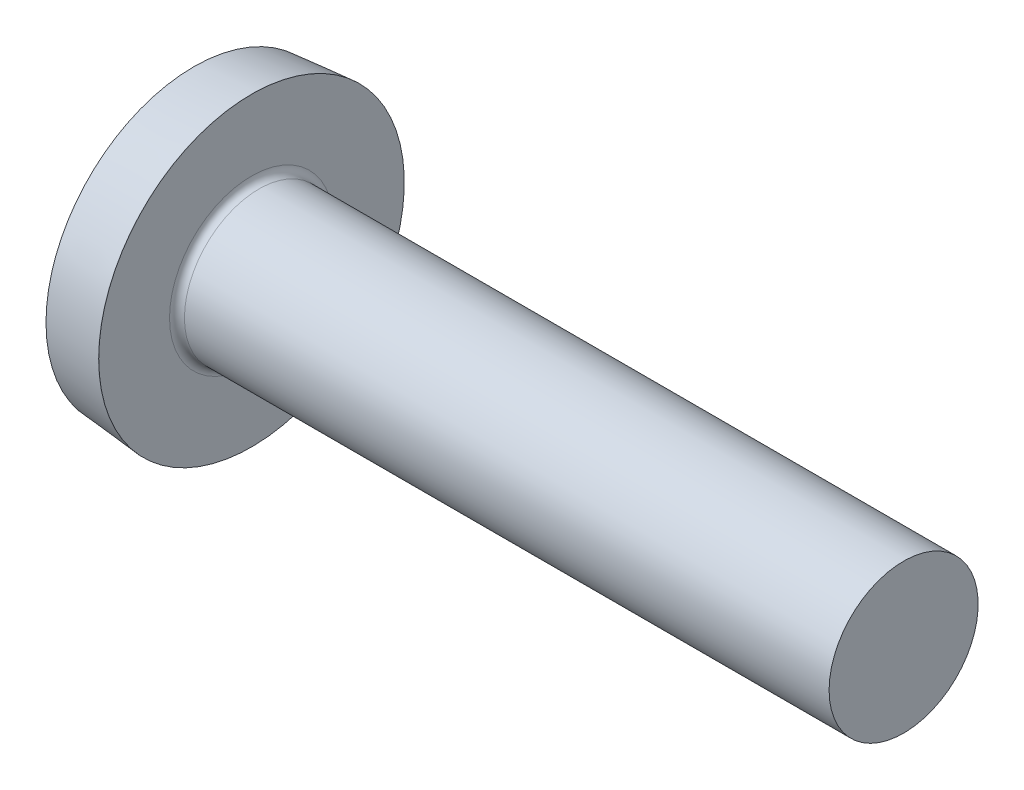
ISO-10303-21;
HEADER;
FILE_DESCRIPTION(('STEP AP214'),'2;1');
FILE_NAME('part.step','',(''),(''),'','','');
FILE_SCHEMA(('AUTOMOTIVE_DESIGN { 1 0 10303 214 1 1 1 1 }'));
ENDSEC;
DATA;
#1=APPLICATION_CONTEXT('core data for automotive mechanical design processes');
#2=APPLICATION_PROTOCOL_DEFINITION('international standard','automotive_design',2000,#1);
#3=PRODUCT_CONTEXT('',#1,'mechanical');
#4=PRODUCT('Part','Part','',(#3));
#5=PRODUCT_RELATED_PRODUCT_CATEGORY('part','',(#4));
#6=PRODUCT_DEFINITION_FORMATION('','',#4);
#7=PRODUCT_DEFINITION_CONTEXT('part definition',#1,'design');
#8=PRODUCT_DEFINITION('design','',#6,#7);
#9=PRODUCT_DEFINITION_SHAPE('','',#8);
#10=(LENGTH_UNIT() NAMED_UNIT(*) SI_UNIT(.MILLI.,.METRE.));
#11=(NAMED_UNIT(*) PLANE_ANGLE_UNIT() SI_UNIT($,.RADIAN.));
#12=(NAMED_UNIT(*) SI_UNIT($,.STERADIAN.) SOLID_ANGLE_UNIT());
#13=UNCERTAINTY_MEASURE_WITH_UNIT(LENGTH_MEASURE(1.E-05),#10,'distance_accuracy_value','');
#14=(GEOMETRIC_REPRESENTATION_CONTEXT(3) GLOBAL_UNCERTAINTY_ASSIGNED_CONTEXT((#13)) GLOBAL_UNIT_ASSIGNED_CONTEXT((#10,
#11,#12)) REPRESENTATION_CONTEXT('',''));
#15=CARTESIAN_POINT('',(0.,0.,0.));
#16=DIRECTION('',(0.,0.,1.));
#17=DIRECTION('',(1.,0.,0.));
#18=AXIS2_PLACEMENT_3D('',#15,#16,#17);
#19=CARTESIAN_POINT('',(19.3439729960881,0.,0.));
#20=DIRECTION('',(-1.,0.,0.));
#21=DIRECTION('',(0.,1.,0.));
#22=AXIS2_PLACEMENT_3D('',#19,#20,#21);
#23=SPHERICAL_SURFACE('',#22,19.3439729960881);
#24=CARTESIAN_POINT('',(1.7,0.,0.));
#25=DIRECTION('',(-1.,0.,0.));
#26=DIRECTION('',(0.,0.,1.));
#27=AXIS2_PLACEMENT_3D('',#24,#25,#26);
#28=CIRCLE('',#27,7.9296600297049);
#29=CARTESIAN_POINT('',(1.7,0.,7.9296600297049));
#30=VERTEX_POINT('',#29);
#31=EDGE_CURVE('E221',#30,#30,#28,.T.);
#32=ORIENTED_EDGE('',*,*,#31,.T.);
#33=EDGE_LOOP('',(#32));
#34=FACE_BOUND('',#33,.T.);
#35=CARTESIAN_POINT('',(0.0647047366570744,0.,0.));
#36=DIRECTION('',(1.,0.,0.));
#37=DIRECTION('',(0.,0.,-1.));
#38=AXIS2_PLACEMENT_3D('',#35,#36,#37);
#39=CIRCLE('',#38,1.5808563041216);
#40=CARTESIAN_POINT('',(0.0647047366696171,-0.709999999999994,-1.41244704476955));
#41=VERTEX_POINT('',#40);
#42=CARTESIAN_POINT('',(0.0647047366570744,-1.41244704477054,-0.71));
#43=VERTEX_POINT('',#42);
#44=EDGE_CURVE('E348',#41,#43,#39,.F.);
#45=ORIENTED_EDGE('',*,*,#44,.F.);
#46=CARTESIAN_POINT('',(19.3439729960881,-0.71,0.));
#47=DIRECTION('',(0.,1.,0.));
#48=DIRECTION('',(0.,0.,1.));
#49=AXIS2_PLACEMENT_3D('',#46,#47,#48);
#50=CIRCLE('',#49,19.3309387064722);
#51=CARTESIAN_POINT('',(0.373159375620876,-0.709999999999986,-3.71394962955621));
#52=VERTEX_POINT('',#51);
#53=EDGE_CURVE('E281',#52,#41,#50,.T.);
#54=ORIENTED_EDGE('',*,*,#53,.F.);
#55=CARTESIAN_POINT('',(17.0500733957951,0.,4.6008515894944));
#56=DIRECTION('',(0.446197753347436,0.,-0.894934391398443));
#57=DIRECTION('',(-0.894934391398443,0.,-0.446197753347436));
#58=AXIS2_PLACEMENT_3D('',#55,#56,#57);
#59=CIRCLE('',#58,18.6483103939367);
#60=CARTESIAN_POINT('',(0.373159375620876,0.710000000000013,-3.71394962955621));
#61=VERTEX_POINT('',#60);
#62=EDGE_CURVE('E255',#52,#61,#59,.T.);
#63=ORIENTED_EDGE('',*,*,#62,.T.);
#64=CARTESIAN_POINT('',(19.3439729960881,0.71,0.));
#65=DIRECTION('',(0.,-1.,0.));
#66=DIRECTION('',(0.,0.,-1.));
#67=AXIS2_PLACEMENT_3D('',#64,#65,#66);
#68=CIRCLE('',#67,19.3309387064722);
#69=CARTESIAN_POINT('',(0.0647047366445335,0.710000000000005,-1.41244704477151));
#70=VERTEX_POINT('',#69);
#71=EDGE_CURVE('E310',#70,#61,#68,.T.);
#72=ORIENTED_EDGE('',*,*,#71,.F.);
#73=CARTESIAN_POINT('',(0.0647047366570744,1.41244704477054,-0.71));
#74=VERTEX_POINT('',#73);
#75=EDGE_CURVE('E363',#74,#70,#39,.F.);
#76=ORIENTED_EDGE('',*,*,#75,.F.);
#77=CARTESIAN_POINT('',(19.3439729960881,0.,-0.71));
#78=DIRECTION('',(0.,0.,1.));
#79=DIRECTION('',(1.,0.,0.));
#80=AXIS2_PLACEMENT_3D('',#77,#78,#79);
#81=CIRCLE('',#80,19.3309387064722);
#82=CARTESIAN_POINT('',(0.373159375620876,3.71394962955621,-0.71));
#83=VERTEX_POINT('',#82);
#84=EDGE_CURVE('E249',#83,#74,#81,.T.);
#85=ORIENTED_EDGE('',*,*,#84,.F.);
#86=CARTESIAN_POINT('',(17.0500733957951,-4.6008515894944,0.));
#87=DIRECTION('',(0.446197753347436,0.894934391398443,0.));
#88=DIRECTION('',(-0.894934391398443,0.446197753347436,0.));
#89=AXIS2_PLACEMENT_3D('',#86,#87,#88);
#90=CIRCLE('',#89,18.6483103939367);
#91=CARTESIAN_POINT('',(0.373159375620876,3.71394962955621,0.71));
#92=VERTEX_POINT('',#91);
#93=EDGE_CURVE('E252',#83,#92,#90,.T.);
#94=ORIENTED_EDGE('',*,*,#93,.T.);
#95=CARTESIAN_POINT('',(19.3439729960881,0.,0.71));
#96=DIRECTION('',(0.,0.,-1.));
#97=DIRECTION('',(0.,1.,0.));
#98=AXIS2_PLACEMENT_3D('',#95,#96,#97);
#99=CIRCLE('',#98,19.3309387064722);
#100=CARTESIAN_POINT('',(0.0647047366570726,1.41244704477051,0.71));
#101=VERTEX_POINT('',#100);
#102=EDGE_CURVE('E245',#101,#92,#99,.T.);
#103=ORIENTED_EDGE('',*,*,#102,.F.);
#104=CARTESIAN_POINT('',(0.0647047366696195,0.709999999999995,1.41244704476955));
#105=VERTEX_POINT('',#104);
#106=EDGE_CURVE('E362',#105,#101,#39,.F.);
#107=ORIENTED_EDGE('',*,*,#106,.F.);
#108=CARTESIAN_POINT('',(0.373159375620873,0.709999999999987,3.71394962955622));
#109=VERTEX_POINT('',#108);
#110=EDGE_CURVE('E265',#109,#105,#68,.T.);
#111=ORIENTED_EDGE('',*,*,#110,.F.);
#112=CARTESIAN_POINT('',(17.0500733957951,0.,-4.6008515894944));
#113=DIRECTION('',(0.446197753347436,0.,0.894934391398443));
#114=DIRECTION('',(0.894934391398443,0.,-0.446197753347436));
#115=AXIS2_PLACEMENT_3D('',#112,#113,#114);
#116=CIRCLE('',#115,18.6483103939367);
#117=CARTESIAN_POINT('',(0.373159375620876,-0.710000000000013,3.71394962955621));
#118=VERTEX_POINT('',#117);
#119=EDGE_CURVE('E55',#109,#118,#116,.T.);
#120=ORIENTED_EDGE('',*,*,#119,.T.);
#121=CARTESIAN_POINT('',(0.064704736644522,-0.710000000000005,1.41244704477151));
#122=VERTEX_POINT('',#121);
#123=EDGE_CURVE('E262',#122,#118,#50,.T.);
#124=ORIENTED_EDGE('',*,*,#123,.F.);
#125=CARTESIAN_POINT('',(0.0647047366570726,-1.41244704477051,0.709999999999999));
#126=VERTEX_POINT('',#125);
#127=EDGE_CURVE('E398',#126,#122,#39,.F.);
#128=ORIENTED_EDGE('',*,*,#127,.F.);
#129=CARTESIAN_POINT('',(0.373159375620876,-3.71394962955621,0.709999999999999));
#130=VERTEX_POINT('',#129);
#131=EDGE_CURVE('E246',#130,#126,#99,.T.);
#132=ORIENTED_EDGE('',*,*,#131,.F.);
#133=CARTESIAN_POINT('',(17.0500733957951,4.6008515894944,0.));
#134=DIRECTION('',(0.446197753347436,-0.894934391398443,0.));
#135=DIRECTION('',(0.894934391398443,0.446197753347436,0.));
#136=AXIS2_PLACEMENT_3D('',#133,#134,#135);
#137=CIRCLE('',#136,18.6483103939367);
#138=CARTESIAN_POINT('',(0.373159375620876,-3.71394962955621,-0.71));
#139=VERTEX_POINT('',#138);
#140=EDGE_CURVE('E242',#130,#139,#137,.T.);
#141=ORIENTED_EDGE('',*,*,#140,.T.);
#142=EDGE_CURVE('E70',#43,#139,#81,.T.);
#143=ORIENTED_EDGE('',*,*,#142,.F.);
#144=EDGE_LOOP('',(#45,#54,#63,#72,#76,#85,#94,#103,#107,#111,#120,#124,#128,#132,#141,#143));
#145=FACE_BOUND('',#144,.T.);
#146=ADVANCED_FACE('F41',(#34,#145),#23,.T.);
#147=CARTESIAN_POINT('',(4.36,1.72618455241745,-0.71));
#148=DIRECTION('',(0.,0.,1.));
#149=DIRECTION('',(1.,0.,0.));
#150=AXIS2_PLACEMENT_3D('',#147,#148,#149);
#151=PLANE('',#150);
#152=ORIENTED_EDGE('',*,*,#84,.T.);
#153=CARTESIAN_POINT('',(-2.29252492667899,1.59478308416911,-0.71));
#154=CARTESIAN_POINT('',(-1.81270612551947,1.55804915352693,-0.71));
#155=CARTESIAN_POINT('',(-1.33290213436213,1.52111940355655,-0.71));
#156=CARTESIAN_POINT('',(-0.373323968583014,1.44673819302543,-0.71));
#157=CARTESIAN_POINT('',(0.106450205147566,1.40928672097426,-0.71));
#158=CARTESIAN_POINT('',(0.826073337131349,1.35262186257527,-0.71));
#159=CARTESIAN_POINT('',(1.06594148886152,1.33365229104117,-0.71));
#160=CARTESIAN_POINT('',(1.54566207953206,1.29552719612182,-0.71));
#161=CARTESIAN_POINT('',(1.78551451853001,1.27637167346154,-0.71));
#162=CARTESIAN_POINT('',(2.26519681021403,1.23784891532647,-0.71));
#163=CARTESIAN_POINT('',(2.50502666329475,1.21848168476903,-0.71));
#164=CARTESIAN_POINT('',(2.98466976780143,1.17950227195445,-0.71));
#165=CARTESIAN_POINT('',(3.22448301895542,1.1598900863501,-0.71));
#166=CARTESIAN_POINT('',(3.80617038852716,1.11197280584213,-0.71));
#167=CARTESIAN_POINT('',(4.14803247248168,1.0835212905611,-0.71));
#168=CARTESIAN_POINT('',(4.83169311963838,1.02589242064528,-0.71));
#169=CARTESIAN_POINT('',(5.17349168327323,0.996715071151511,-0.71));
#170=CARTESIAN_POINT('',(5.8569822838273,0.937423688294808,-0.71));
#171=CARTESIAN_POINT('',(6.19867432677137,0.907309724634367,-0.71));
#172=CARTESIAN_POINT('',(6.88195546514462,0.845823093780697,-0.71));
#173=CARTESIAN_POINT('',(7.22354455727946,0.814450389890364,-0.71));
#174=CARTESIAN_POINT('',(7.90666332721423,0.749944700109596,-0.71));
#175=CARTESIAN_POINT('',(8.24819295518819,0.716811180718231,-0.71));
#176=CARTESIAN_POINT('',(8.76027240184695,0.665129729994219,-0.71));
#177=CARTESIAN_POINT('',(8.93092214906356,0.64757320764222,-0.71));
#178=CARTESIAN_POINT('',(9.27213637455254,0.611612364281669,-0.71));
#179=CARTESIAN_POINT('',(9.44270085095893,0.593208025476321,-0.71));
#180=CARTESIAN_POINT('',(9.78376758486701,0.555282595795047,-0.71));
#181=CARTESIAN_POINT('',(9.95426979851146,0.53576110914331,-0.71));
#182=CARTESIAN_POINT('',(10.2950864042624,0.495201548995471,-0.71));
#183=CARTESIAN_POINT('',(10.4654008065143,0.474163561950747,-0.71));
#184=CARTESIAN_POINT('',(10.7206812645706,0.440920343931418,-0.71));
#185=CARTESIAN_POINT('',(10.805756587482,0.42955626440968,-0.71));
#186=CARTESIAN_POINT('',(10.9758063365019,0.406110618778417,-0.71));
#187=CARTESIAN_POINT('',(11.0607807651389,0.394029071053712,-0.71));
#188=CARTESIAN_POINT('',(11.2306124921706,0.368945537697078,-0.71));
#189=CARTESIAN_POINT('',(11.3154697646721,0.355943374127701,-0.71));
#190=CARTESIAN_POINT('',(11.4849791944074,0.32862517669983,-0.71));
#191=CARTESIAN_POINT('',(11.5696313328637,0.314309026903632,-0.71));
#192=CARTESIAN_POINT('',(11.6541376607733,0.299139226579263,-0.71));
#193=B_SPLINE_CURVE_WITH_KNOTS('',3,(#153,#154,#155,#156,#157,#158,#159,#160,#161,#162,#163,
#164,#165,#166,#167,#168,#169,#170,#171,#172,#173,#174,#175,#176,#177,#178,#179,#180,#181,#182,
#183,#184,#185,#186,#187,#188,#189,#190,#191,#192),.UNSPECIFIED.,.F.,.F.,(4,2,2,2,2,2,2,2,2,2,2,
2,2,2,2,2,2,2,2,4),(0.,1.44366890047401,2.88736964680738,3.60922079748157,4.33106913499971,
5.05290074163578,5.77474222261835,6.80387353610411,7.83299756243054,8.86204518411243,
9.89112282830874,10.9205140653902,11.4351640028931,11.9498247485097,12.464668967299,
12.9794838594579,13.2369743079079,13.4944581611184,13.7519919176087,14.009548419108),.UNSPECIFIED.);
#194=CARTESIAN_POINT('',(4.36,1.06563607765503,-0.71));
#195=VERTEX_POINT('',#194);
#196=EDGE_CURVE('E385',#74,#195,#193,.T.);
#197=ORIENTED_EDGE('',*,*,#196,.T.);
#198=DIRECTION('',(0.,1.,0.));
#199=VECTOR('',#198,1.);
#200=CARTESIAN_POINT('',(4.36,-1.72618455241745,-0.71));
#201=LINE('',#200,#199);
#202=CARTESIAN_POINT('',(4.36,1.72618455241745,-0.71));
#203=VERTEX_POINT('',#202);
#204=EDGE_CURVE('E331',#195,#203,#201,.T.);
#205=ORIENTED_EDGE('',*,*,#204,.T.);
#206=DIRECTION('',(0.894934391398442,-0.446197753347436,0.));
#207=VECTOR('',#206,1.);
#208=CARTESIAN_POINT('',(0.,3.9,-0.71));
#209=LINE('',#208,#207);
#210=EDGE_CURVE('E222',#83,#203,#209,.T.);
#211=ORIENTED_EDGE('',*,*,#210,.F.);
#212=EDGE_LOOP('',(#152,#197,#205,#211));
#213=FACE_BOUND('',#212,.T.);
#214=ADVANCED_FACE('F176',(#213),#151,.T.);
#215=CARTESIAN_POINT('',(4.36,-1.72618455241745,-0.71));
#216=VERTEX_POINT('',#215);
#217=CARTESIAN_POINT('',(4.36,-1.06563607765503,-0.71));
#218=VERTEX_POINT('',#217);
#219=EDGE_CURVE('E230',#216,#218,#201,.T.);
#220=ORIENTED_EDGE('',*,*,#219,.T.);
#221=CARTESIAN_POINT('',(-2.29252492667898,-1.59478308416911,-0.71));
#222=CARTESIAN_POINT('',(-1.81270612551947,-1.55804915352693,-0.71));
#223=CARTESIAN_POINT('',(-1.33290213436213,-1.52111940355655,-0.71));
#224=CARTESIAN_POINT('',(-0.373323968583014,-1.44673819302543,-0.71));
#225=CARTESIAN_POINT('',(0.106450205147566,-1.40928672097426,-0.71));
#226=CARTESIAN_POINT('',(0.82607333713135,-1.35262186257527,-0.71));
#227=CARTESIAN_POINT('',(1.06594148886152,-1.33365229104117,-0.71));
#228=CARTESIAN_POINT('',(1.54566207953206,-1.29552719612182,-0.71));
#229=CARTESIAN_POINT('',(1.78551451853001,-1.27637167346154,-0.71));
#230=CARTESIAN_POINT('',(2.26519681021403,-1.23784891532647,-0.71));
#231=CARTESIAN_POINT('',(2.50502666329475,-1.21848168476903,-0.71));
#232=CARTESIAN_POINT('',(2.98466976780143,-1.17950227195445,-0.71));
#233=CARTESIAN_POINT('',(3.22448301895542,-1.1598900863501,-0.71));
#234=CARTESIAN_POINT('',(3.80617038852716,-1.11197280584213,-0.71));
#235=CARTESIAN_POINT('',(4.14803247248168,-1.0835212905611,-0.71));
#236=CARTESIAN_POINT('',(4.83169311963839,-1.02589242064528,-0.71));
#237=CARTESIAN_POINT('',(5.17349168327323,-0.996715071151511,-0.71));
#238=CARTESIAN_POINT('',(5.8569822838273,-0.937423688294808,-0.71));
#239=CARTESIAN_POINT('',(6.19867432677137,-0.907309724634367,-0.71));
#240=CARTESIAN_POINT('',(6.88195546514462,-0.845823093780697,-0.71));
#241=CARTESIAN_POINT('',(7.22354455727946,-0.814450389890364,-0.71));
#242=CARTESIAN_POINT('',(7.90666332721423,-0.749944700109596,-0.71));
#243=CARTESIAN_POINT('',(8.24819295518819,-0.716811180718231,-0.71));
#244=CARTESIAN_POINT('',(8.76027240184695,-0.665129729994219,-0.71));
#245=CARTESIAN_POINT('',(8.93092214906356,-0.64757320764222,-0.71));
#246=CARTESIAN_POINT('',(9.27213637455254,-0.611612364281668,-0.71));
#247=CARTESIAN_POINT('',(9.44270085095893,-0.593208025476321,-0.71));
#248=CARTESIAN_POINT('',(9.78376758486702,-0.555282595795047,-0.71));
#249=CARTESIAN_POINT('',(9.95426979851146,-0.53576110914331,-0.71));
#250=CARTESIAN_POINT('',(10.2950864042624,-0.49520154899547,-0.71));
#251=CARTESIAN_POINT('',(10.4654008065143,-0.474163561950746,-0.71));
#252=CARTESIAN_POINT('',(10.7206812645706,-0.440920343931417,-0.71));
#253=CARTESIAN_POINT('',(10.805756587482,-0.429556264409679,-0.71));
#254=CARTESIAN_POINT('',(10.9758063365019,-0.406110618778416,-0.71));
#255=CARTESIAN_POINT('',(11.0607807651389,-0.394029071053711,-0.71));
#256=CARTESIAN_POINT('',(11.2306124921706,-0.368945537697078,-0.71));
#257=CARTESIAN_POINT('',(11.3154697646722,-0.3559433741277,-0.71));
#258=CARTESIAN_POINT('',(11.4849791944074,-0.328625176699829,-0.71));
#259=CARTESIAN_POINT('',(11.5696313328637,-0.314309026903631,-0.71));
#260=CARTESIAN_POINT('',(11.6541376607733,-0.299139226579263,-0.71));
#261=B_SPLINE_CURVE_WITH_KNOTS('',3,(#221,#222,#223,#224,#225,#226,#227,#228,#229,#230,#231,
#232,#233,#234,#235,#236,#237,#238,#239,#240,#241,#242,#243,#244,#245,#246,#247,#248,#249,#250,
#251,#252,#253,#254,#255,#256,#257,#258,#259,#260),.UNSPECIFIED.,.F.,.F.,(4,2,2,2,2,2,2,2,2,2,2,
2,2,2,2,2,2,2,2,4),(0.,1.44366890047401,2.88736964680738,3.60922079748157,4.33106913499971,
5.05290074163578,5.77474222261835,6.80387353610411,7.83299756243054,8.86204518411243,
9.89112282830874,10.9205140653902,11.4351640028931,11.9498247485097,12.464668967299,
12.9794838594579,13.2369743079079,13.4944581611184,13.7519919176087,14.0095484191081),.UNSPECIFIED.);
#262=EDGE_CURVE('E361',#218,#43,#261,.F.);
#263=ORIENTED_EDGE('',*,*,#262,.T.);
#264=ORIENTED_EDGE('',*,*,#142,.T.);
#265=DIRECTION('',(0.894934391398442,0.446197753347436,0.));
#266=VECTOR('',#265,1.);
#267=CARTESIAN_POINT('',(0.,-3.9,-0.71));
#268=LINE('',#267,#266);
#269=EDGE_CURVE('E313',#139,#216,#268,.T.);
#270=ORIENTED_EDGE('',*,*,#269,.T.);
#271=EDGE_LOOP('',(#220,#263,#264,#270));
#272=FACE_BOUND('',#271,.T.);
#273=ADVANCED_FACE('F183',(#272),#151,.T.);
#274=CARTESIAN_POINT('',(4.36,-1.72618455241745,0.71));
#275=DIRECTION('',(0.,0.,-1.));
#276=DIRECTION('',(0.,1.,0.));
#277=AXIS2_PLACEMENT_3D('',#274,#275,#276);
#278=PLANE('',#277);
#279=DIRECTION('',(0.,-1.,0.));
#280=VECTOR('',#279,1.);
#281=CARTESIAN_POINT('',(4.36,1.72618455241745,0.71));
#282=LINE('',#281,#280);
#283=CARTESIAN_POINT('',(4.36,1.72618455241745,0.71));
#284=VERTEX_POINT('',#283);
#285=CARTESIAN_POINT('',(4.36,1.06563607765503,0.709999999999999));
#286=VERTEX_POINT('',#285);
#287=EDGE_CURVE('E321',#284,#286,#282,.T.);
#288=ORIENTED_EDGE('',*,*,#287,.T.);
#289=CARTESIAN_POINT('',(-2.29252491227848,1.59478308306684,0.71));
#290=CARTESIAN_POINT('',(-1.81270611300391,1.55804915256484,0.71));
#291=CARTESIAN_POINT('',(-1.33290212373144,1.52111940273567,0.71));
#292=CARTESIAN_POINT('',(-0.373323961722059,1.44673819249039,0.71));
#293=CARTESIAN_POINT('',(0.106450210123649,1.40928672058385,0.71));
#294=CARTESIAN_POINT('',(0.826073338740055,1.35262186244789,0.71));
#295=CARTESIAN_POINT('',(1.06594148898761,1.3336522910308,0.71));
#296=CARTESIAN_POINT('',(1.54566207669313,1.2955271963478,0.71));
#297=CARTESIAN_POINT('',(1.78551451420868,1.27637167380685,0.71));
#298=CARTESIAN_POINT('',(2.26519680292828,1.23784891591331,0.71));
#299=CARTESIAN_POINT('',(2.50502665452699,1.21848168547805,0.71));
#300=CARTESIAN_POINT('',(2.98466975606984,1.17950227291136,0.71));
#301=CARTESIAN_POINT('',(3.22448300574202,1.15989008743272,0.71));
#302=CARTESIAN_POINT('',(3.80617037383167,1.11197280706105,0.71));
#303=CARTESIAN_POINT('',(4.1480324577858,1.08352129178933,0.71));
#304=CARTESIAN_POINT('',(4.83169310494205,1.02589242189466,0.71));
#305=CARTESIAN_POINT('',(5.17349166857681,0.99671507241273,0.71));
#306=CARTESIAN_POINT('',(5.85698226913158,0.937423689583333,0.71));
#307=CARTESIAN_POINT('',(6.19867431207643,0.907309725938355,0.71));
#308=CARTESIAN_POINT('',(6.88195545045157,0.845823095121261,0.71));
#309=CARTESIAN_POINT('',(7.22354454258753,0.81445039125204,0.71));
#310=CARTESIAN_POINT('',(7.90666331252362,0.749944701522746,0.71));
#311=CARTESIAN_POINT('',(8.2481929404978,0.716811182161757,0.71));
#312=CARTESIAN_POINT('',(8.76027238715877,0.665129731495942,0.71));
#313=CARTESIAN_POINT('',(8.93092213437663,0.647573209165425,0.71));
#314=CARTESIAN_POINT('',(9.27213635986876,0.611612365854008,0.71));
#315=CARTESIAN_POINT('',(9.44270083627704,0.593208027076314,0.71));
#316=CARTESIAN_POINT('',(9.78376757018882,0.555282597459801,0.71));
#317=CARTESIAN_POINT('',(9.95426978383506,0.535761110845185,0.71));
#318=CARTESIAN_POINT('',(10.295086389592,0.495201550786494,0.71));
#319=CARTESIAN_POINT('',(10.4654007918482,0.474163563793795,0.71));
#320=CARTESIAN_POINT('',(10.7206812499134,0.440920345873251,0.71));
#321=CARTESIAN_POINT('',(10.8057565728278,0.429556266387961,0.71));
#322=CARTESIAN_POINT('',(10.9758063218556,0.406110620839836,0.71));
#323=CARTESIAN_POINT('',(11.0607807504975,0.39402907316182,0.71));
#324=CARTESIAN_POINT('',(11.230612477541,0.368945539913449,0.71));
#325=CARTESIAN_POINT('',(11.3154697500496,0.355943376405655,0.71));
#326=CARTESIAN_POINT('',(11.4849791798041,0.328625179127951,0.71));
#327=CARTESIAN_POINT('',(11.5696313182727,0.314309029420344,0.71));
#328=CARTESIAN_POINT('',(11.6541376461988,0.299139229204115,0.71));
#329=B_SPLINE_CURVE_WITH_KNOTS('',3,(#289,#290,#291,#292,#293,#294,#295,#296,#297,#298,#299,
#300,#301,#302,#303,#304,#305,#306,#307,#308,#309,#310,#311,#312,#313,#314,#315,#316,#317,#318,
#319,#320,#321,#322,#323,#324,#325,#326,#327,#328),.UNSPECIFIED.,.F.,.F.,(4,2,2,2,2,2,2,2,2,2,2,
2,2,2,2,2,2,2,2,4),(0.,1.44366889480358,2.88736963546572,3.60922078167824,4.33106911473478,
5.05290071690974,5.77474219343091,6.80387350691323,7.8329975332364,8.86204515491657,
9.89112279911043,10.9205140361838,11.4351639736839,11.9498247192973,12.4646689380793,
12.979483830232,13.2369742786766,13.4944581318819,13.7519918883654,14.0095483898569),.UNSPECIFIED.);
#330=EDGE_CURVE('E286',#286,#101,#329,.F.);
#331=ORIENTED_EDGE('',*,*,#330,.T.);
#332=ORIENTED_EDGE('',*,*,#102,.T.);
#333=DIRECTION('',(0.894934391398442,-0.446197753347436,0.));
#334=VECTOR('',#333,1.);
#335=CARTESIAN_POINT('',(0.,3.9,0.71));
#336=LINE('',#335,#334);
#337=EDGE_CURVE('E227',#92,#284,#336,.T.);
#338=ORIENTED_EDGE('',*,*,#337,.T.);
#339=EDGE_LOOP('',(#288,#331,#332,#338));
#340=FACE_BOUND('',#339,.T.);
#341=ADVANCED_FACE('F381',(#340),#278,.T.);
#342=ORIENTED_EDGE('',*,*,#131,.T.);
#343=CARTESIAN_POINT('',(-2.29252491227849,-1.59478308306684,0.709999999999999));
#344=CARTESIAN_POINT('',(-1.81270611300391,-1.55804915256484,0.709999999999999));
#345=CARTESIAN_POINT('',(-1.33290212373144,-1.52111940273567,0.709999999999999));
#346=CARTESIAN_POINT('',(-0.373323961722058,-1.44673819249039,0.709999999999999));
#347=CARTESIAN_POINT('',(0.10645021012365,-1.40928672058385,0.709999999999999));
#348=CARTESIAN_POINT('',(0.826073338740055,-1.3526218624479,0.709999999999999));
#349=CARTESIAN_POINT('',(1.06594148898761,-1.3336522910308,0.709999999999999));
#350=CARTESIAN_POINT('',(1.54566207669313,-1.2955271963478,0.709999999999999));
#351=CARTESIAN_POINT('',(1.78551451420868,-1.27637167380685,0.709999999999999));
#352=CARTESIAN_POINT('',(2.26519680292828,-1.23784891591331,0.709999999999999));
#353=CARTESIAN_POINT('',(2.50502665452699,-1.21848168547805,0.71));
#354=CARTESIAN_POINT('',(2.98466975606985,-1.17950227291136,0.71));
#355=CARTESIAN_POINT('',(3.22448300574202,-1.15989008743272,0.71));
#356=CARTESIAN_POINT('',(3.80617037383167,-1.11197280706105,0.71));
#357=CARTESIAN_POINT('',(4.1480324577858,-1.08352129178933,0.71));
#358=CARTESIAN_POINT('',(4.83169310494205,-1.02589242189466,0.71));
#359=CARTESIAN_POINT('',(5.17349166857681,-0.99671507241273,0.71));
#360=CARTESIAN_POINT('',(5.85698226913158,-0.937423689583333,0.71));
#361=CARTESIAN_POINT('',(6.19867431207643,-0.907309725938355,0.71));
#362=CARTESIAN_POINT('',(6.88195545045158,-0.845823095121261,0.71));
#363=CARTESIAN_POINT('',(7.22354454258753,-0.81445039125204,0.71));
#364=CARTESIAN_POINT('',(7.90666331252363,-0.749944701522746,0.71));
#365=CARTESIAN_POINT('',(8.24819294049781,-0.716811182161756,0.71));
#366=CARTESIAN_POINT('',(8.76027238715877,-0.665129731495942,0.71));
#367=CARTESIAN_POINT('',(8.93092213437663,-0.647573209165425,0.71));
#368=CARTESIAN_POINT('',(9.27213635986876,-0.611612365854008,0.71));
#369=CARTESIAN_POINT('',(9.44270083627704,-0.593208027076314,0.71));
#370=CARTESIAN_POINT('',(9.78376757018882,-0.555282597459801,0.71));
#371=CARTESIAN_POINT('',(9.95426978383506,-0.535761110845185,0.71));
#372=CARTESIAN_POINT('',(10.295086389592,-0.495201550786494,0.71));
#373=CARTESIAN_POINT('',(10.4654007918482,-0.474163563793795,0.71));
#374=CARTESIAN_POINT('',(10.7206812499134,-0.440920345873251,0.71));
#375=CARTESIAN_POINT('',(10.8057565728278,-0.429556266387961,0.71));
#376=CARTESIAN_POINT('',(10.9758063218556,-0.406110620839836,0.71));
#377=CARTESIAN_POINT('',(11.0607807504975,-0.394029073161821,0.71));
#378=CARTESIAN_POINT('',(11.230612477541,-0.36894553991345,0.71));
#379=CARTESIAN_POINT('',(11.3154697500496,-0.355943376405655,0.71));
#380=CARTESIAN_POINT('',(11.4849791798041,-0.328625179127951,0.71));
#381=CARTESIAN_POINT('',(11.5696313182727,-0.314309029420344,0.71));
#382=CARTESIAN_POINT('',(11.6541376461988,-0.299139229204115,0.71));
#383=B_SPLINE_CURVE_WITH_KNOTS('',3,(#343,#344,#345,#346,#347,#348,#349,#350,#351,#352,#353,
#354,#355,#356,#357,#358,#359,#360,#361,#362,#363,#364,#365,#366,#367,#368,#369,#370,#371,#372,
#373,#374,#375,#376,#377,#378,#379,#380,#381,#382),.UNSPECIFIED.,.F.,.F.,(4,2,2,2,2,2,2,2,2,2,2,
2,2,2,2,2,2,2,2,4),(0.,1.44366889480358,2.88736963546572,3.60922078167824,4.33106911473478,
5.05290071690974,5.77474219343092,6.80387350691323,7.8329975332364,8.86204515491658,
9.89112279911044,10.9205140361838,11.4351639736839,11.9498247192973,12.4646689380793,
12.979483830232,13.2369742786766,13.4944581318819,13.7519918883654,14.0095483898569),.UNSPECIFIED.);
#384=CARTESIAN_POINT('',(4.36,-1.06563607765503,0.709999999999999));
#385=VERTEX_POINT('',#384);
#386=EDGE_CURVE('E399',#126,#385,#383,.T.);
#387=ORIENTED_EDGE('',*,*,#386,.T.);
#388=CARTESIAN_POINT('',(4.36,-1.72618455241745,0.71));
#389=VERTEX_POINT('',#388);
#390=EDGE_CURVE('E323',#385,#389,#282,.T.);
#391=ORIENTED_EDGE('',*,*,#390,.T.);
#392=DIRECTION('',(0.894934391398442,0.446197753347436,0.));
#393=VECTOR('',#392,1.);
#394=CARTESIAN_POINT('',(0.,-3.9,0.709999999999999));
#395=LINE('',#394,#393);
#396=EDGE_CURVE('E315',#130,#389,#395,.T.);
#397=ORIENTED_EDGE('',*,*,#396,.F.);
#398=EDGE_LOOP('',(#342,#387,#391,#397));
#399=FACE_BOUND('',#398,.T.);
#400=ADVANCED_FACE('F428',(#399),#278,.T.);
#401=CARTESIAN_POINT('',(4.36,1.72618455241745,-0.71));
#402=DIRECTION('',(-1.,0.,0.));
#403=DIRECTION('',(0.,0.,1.));
#404=AXIS2_PLACEMENT_3D('',#401,#402,#403);
#405=PLANE('',#404);
#406=ORIENTED_EDGE('',*,*,#390,.F.);
#407=CARTESIAN_POINT('',(4.36,0.,0.));
#408=DIRECTION('',(-1.,0.,0.));
#409=DIRECTION('',(0.,0.,1.));
#410=AXIS2_PLACEMENT_3D('',#407,#408,#409);
#411=CIRCLE('',#410,1.2805);
#412=EDGE_CURVE('E356',#218,#385,#411,.T.);
#413=ORIENTED_EDGE('',*,*,#412,.F.);
#414=ORIENTED_EDGE('',*,*,#219,.F.);
#415=DIRECTION('',(0.,0.,1.));
#416=VECTOR('',#415,1.);
#417=CARTESIAN_POINT('',(4.36,-1.72618455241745,-0.71));
#418=LINE('',#417,#416);
#419=EDGE_CURVE('E318',#216,#389,#418,.T.);
#420=ORIENTED_EDGE('',*,*,#419,.T.);
#421=EDGE_LOOP('',(#406,#413,#414,#420));
#422=FACE_BOUND('',#421,.T.);
#423=ADVANCED_FACE('F422',(#422),#405,.T.);
#424=DIRECTION('',(0.,0.,-1.));
#425=VECTOR('',#424,1.);
#426=CARTESIAN_POINT('',(4.36,-0.710000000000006,1.72618455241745));
#427=LINE('',#426,#425);
#428=CARTESIAN_POINT('',(4.36,-0.709999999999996,-1.06563607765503));
#429=VERTEX_POINT('',#428);
#430=CARTESIAN_POINT('',(4.36,-0.709999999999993,-1.72618455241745));
#431=VERTEX_POINT('',#430);
#432=EDGE_CURVE('E304',#429,#431,#427,.T.);
#433=ORIENTED_EDGE('',*,*,#432,.F.);
#434=CARTESIAN_POINT('',(4.36,0.710000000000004,-1.06563607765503));
#435=VERTEX_POINT('',#434);
#436=EDGE_CURVE('E62',#435,#429,#411,.T.);
#437=ORIENTED_EDGE('',*,*,#436,.F.);
#438=DIRECTION('',(0.,0.,1.));
#439=VECTOR('',#438,1.);
#440=CARTESIAN_POINT('',(4.36,0.710000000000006,-1.72618455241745));
#441=LINE('',#440,#439);
#442=CARTESIAN_POINT('',(4.36,0.710000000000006,-1.72618455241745));
#443=VERTEX_POINT('',#442);
#444=EDGE_CURVE('E307',#443,#435,#441,.T.);
#445=ORIENTED_EDGE('',*,*,#444,.F.);
#446=DIRECTION('',(0.,-1.,0.));
#447=VECTOR('',#446,1.);
#448=CARTESIAN_POINT('',(4.36,0.710000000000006,-1.72618455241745));
#449=LINE('',#448,#447);
#450=EDGE_CURVE('E298',#443,#431,#449,.T.);
#451=ORIENTED_EDGE('',*,*,#450,.T.);
#452=EDGE_LOOP('',(#433,#437,#445,#451));
#453=FACE_BOUND('',#452,.T.);
#454=ADVANCED_FACE('F351',(#453),#405,.T.);
#455=ORIENTED_EDGE('',*,*,#204,.F.);
#456=EDGE_CURVE('E355',#286,#195,#411,.T.);
#457=ORIENTED_EDGE('',*,*,#456,.F.);
#458=ORIENTED_EDGE('',*,*,#287,.F.);
#459=DIRECTION('',(0.,0.,-1.));
#460=VECTOR('',#459,1.);
#461=CARTESIAN_POINT('',(4.36,1.72618455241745,0.71));
#462=LINE('',#461,#460);
#463=EDGE_CURVE('E324',#284,#203,#462,.T.);
#464=ORIENTED_EDGE('',*,*,#463,.T.);
#465=EDGE_LOOP('',(#455,#457,#458,#464));
#466=FACE_BOUND('',#465,.T.);
#467=ADVANCED_FACE('F423',(#466),#405,.T.);
#468=CARTESIAN_POINT('',(4.36,0.709999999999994,1.72618455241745));
#469=DIRECTION('',(0.,-1.,0.));
#470=DIRECTION('',(1.,0.,0.));
#471=AXIS2_PLACEMENT_3D('',#468,#469,#470);
#472=PLANE('',#471);
#473=ORIENTED_EDGE('',*,*,#110,.T.);
#474=CARTESIAN_POINT('',(-2.29252491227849,0.709999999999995,1.59478308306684));
#475=CARTESIAN_POINT('',(-1.81270611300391,0.709999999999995,1.55804915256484));
#476=CARTESIAN_POINT('',(-1.33290212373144,0.709999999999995,1.52111940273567));
#477=CARTESIAN_POINT('',(-0.373323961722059,0.709999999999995,1.44673819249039));
#478=CARTESIAN_POINT('',(0.106450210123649,0.709999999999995,1.40928672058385));
#479=CARTESIAN_POINT('',(0.826073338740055,0.709999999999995,1.3526218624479));
#480=CARTESIAN_POINT('',(1.06594148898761,0.709999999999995,1.3336522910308));
#481=CARTESIAN_POINT('',(1.54566207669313,0.709999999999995,1.2955271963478));
#482=CARTESIAN_POINT('',(1.78551451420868,0.709999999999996,1.27637167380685));
#483=CARTESIAN_POINT('',(2.26519680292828,0.709999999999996,1.23784891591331));
#484=CARTESIAN_POINT('',(2.50502665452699,0.709999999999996,1.21848168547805));
#485=CARTESIAN_POINT('',(2.98466975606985,0.709999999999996,1.17950227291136));
#486=CARTESIAN_POINT('',(3.22448300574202,0.709999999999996,1.15989008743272));
#487=CARTESIAN_POINT('',(3.80617037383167,0.709999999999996,1.11197280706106));
#488=CARTESIAN_POINT('',(4.1480324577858,0.709999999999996,1.08352129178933));
#489=CARTESIAN_POINT('',(4.83169310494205,0.709999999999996,1.02589242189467));
#490=CARTESIAN_POINT('',(5.17349166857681,0.709999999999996,0.996715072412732));
#491=CARTESIAN_POINT('',(5.85698226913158,0.709999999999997,0.937423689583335));
#492=CARTESIAN_POINT('',(6.19867431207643,0.709999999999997,0.907309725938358));
#493=CARTESIAN_POINT('',(6.88195545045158,0.709999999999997,0.845823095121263));
#494=CARTESIAN_POINT('',(7.22354454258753,0.709999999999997,0.814450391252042));
#495=CARTESIAN_POINT('',(7.90666331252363,0.709999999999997,0.749944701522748));
#496=CARTESIAN_POINT('',(8.24819294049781,0.709999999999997,0.716811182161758));
#497=CARTESIAN_POINT('',(8.76027238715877,0.709999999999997,0.665129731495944));
#498=CARTESIAN_POINT('',(8.93092213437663,0.709999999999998,0.647573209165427));
#499=CARTESIAN_POINT('',(9.27213635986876,0.709999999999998,0.611612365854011));
#500=CARTESIAN_POINT('',(9.44270083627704,0.709999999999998,0.593208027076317));
#501=CARTESIAN_POINT('',(9.78376757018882,0.709999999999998,0.555282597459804));
#502=CARTESIAN_POINT('',(9.95426978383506,0.709999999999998,0.535761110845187));
#503=CARTESIAN_POINT('',(10.295086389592,0.709999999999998,0.495201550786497));
#504=CARTESIAN_POINT('',(10.4654007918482,0.709999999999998,0.474163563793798));
#505=CARTESIAN_POINT('',(10.7206812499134,0.709999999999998,0.440920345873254));
#506=CARTESIAN_POINT('',(10.8057565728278,0.709999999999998,0.429556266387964));
#507=CARTESIAN_POINT('',(10.9758063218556,0.709999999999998,0.406110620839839));
#508=CARTESIAN_POINT('',(11.0607807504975,0.709999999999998,0.394029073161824));
#509=CARTESIAN_POINT('',(11.230612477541,0.709999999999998,0.368945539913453));
#510=CARTESIAN_POINT('',(11.3154697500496,0.709999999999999,0.355943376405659));
#511=CARTESIAN_POINT('',(11.4849791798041,0.709999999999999,0.328625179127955));
#512=CARTESIAN_POINT('',(11.5696313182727,0.709999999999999,0.314309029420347));
#513=CARTESIAN_POINT('',(11.6541376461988,0.709999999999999,0.299139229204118));
#514=B_SPLINE_CURVE_WITH_KNOTS('',3,(#474,#475,#476,#477,#478,#479,#480,#481,#482,#483,#484,
#485,#486,#487,#488,#489,#490,#491,#492,#493,#494,#495,#496,#497,#498,#499,#500,#501,#502,#503,
#504,#505,#506,#507,#508,#509,#510,#511,#512,#513),.UNSPECIFIED.,.F.,.F.,(4,2,2,2,2,2,2,2,2,2,2,
2,2,2,2,2,2,2,2,4),(0.,1.44366889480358,2.88736963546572,3.60922078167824,4.33106911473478,
5.05290071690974,5.77474219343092,6.80387350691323,7.8329975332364,8.86204515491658,
9.89112279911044,10.9205140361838,11.4351639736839,11.9498247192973,12.4646689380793,
12.979483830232,13.2369742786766,13.4944581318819,13.7519918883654,14.0095483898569),.UNSPECIFIED.);
#515=CARTESIAN_POINT('',(4.36,0.709999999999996,1.06563607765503));
#516=VERTEX_POINT('',#515);
#517=EDGE_CURVE('E446',#105,#516,#514,.T.);
#518=ORIENTED_EDGE('',*,*,#517,.T.);
#519=CARTESIAN_POINT('',(4.36,0.709999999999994,1.72618455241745));
#520=VERTEX_POINT('',#519);
#521=EDGE_CURVE('E279',#516,#520,#441,.T.);
#522=ORIENTED_EDGE('',*,*,#521,.T.);
#523=DIRECTION('',(0.894934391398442,0.,-0.446197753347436));
#524=VECTOR('',#523,1.);
#525=CARTESIAN_POINT('',(0.,0.709999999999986,3.9));
#526=LINE('',#525,#524);
#527=EDGE_CURVE('E272',#109,#520,#526,.T.);
#528=ORIENTED_EDGE('',*,*,#527,.F.);
#529=EDGE_LOOP('',(#473,#518,#522,#528));
#530=FACE_BOUND('',#529,.T.);
#531=ADVANCED_FACE('F276',(#530),#472,.T.);
#532=CARTESIAN_POINT('',(4.36,-0.709999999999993,-1.72618455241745));
#533=DIRECTION('',(0.,1.,0.));
#534=DIRECTION('',(0.,0.,1.));
#535=AXIS2_PLACEMENT_3D('',#532,#533,#534);
#536=PLANE('',#535);
#537=CARTESIAN_POINT('',(4.36,-0.710000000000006,1.72618455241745));
#538=VERTEX_POINT('',#537);
#539=CARTESIAN_POINT('',(4.36,-0.710000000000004,1.06563607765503));
#540=VERTEX_POINT('',#539);
#541=EDGE_CURVE('E301',#538,#540,#427,.T.);
#542=ORIENTED_EDGE('',*,*,#541,.T.);
#543=CARTESIAN_POINT('',(-2.29252491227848,-0.710000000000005,1.59478308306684));
#544=CARTESIAN_POINT('',(-1.81270611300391,-0.710000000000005,1.55804915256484));
#545=CARTESIAN_POINT('',(-1.33290212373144,-0.710000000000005,1.52111940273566));
#546=CARTESIAN_POINT('',(-0.373323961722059,-0.710000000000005,1.44673819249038));
#547=CARTESIAN_POINT('',(0.106450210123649,-0.710000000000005,1.40928672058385));
#548=CARTESIAN_POINT('',(0.826073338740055,-0.710000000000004,1.35262186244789));
#549=CARTESIAN_POINT('',(1.06594148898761,-0.710000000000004,1.3336522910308));
#550=CARTESIAN_POINT('',(1.54566207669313,-0.710000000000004,1.29552719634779));
#551=CARTESIAN_POINT('',(1.78551451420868,-0.710000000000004,1.27637167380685));
#552=CARTESIAN_POINT('',(2.26519680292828,-0.710000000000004,1.23784891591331));
#553=CARTESIAN_POINT('',(2.50502665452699,-0.710000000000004,1.21848168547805));
#554=CARTESIAN_POINT('',(2.98466975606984,-0.710000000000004,1.17950227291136));
#555=CARTESIAN_POINT('',(3.22448300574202,-0.710000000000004,1.15989008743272));
#556=CARTESIAN_POINT('',(3.80617037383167,-0.710000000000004,1.11197280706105));
#557=CARTESIAN_POINT('',(4.1480324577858,-0.710000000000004,1.08352129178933));
#558=CARTESIAN_POINT('',(4.83169310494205,-0.710000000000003,1.02589242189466));
#559=CARTESIAN_POINT('',(5.17349166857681,-0.710000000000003,0.996715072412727));
#560=CARTESIAN_POINT('',(5.85698226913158,-0.710000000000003,0.93742368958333));
#561=CARTESIAN_POINT('',(6.19867431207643,-0.710000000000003,0.907309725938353));
#562=CARTESIAN_POINT('',(6.88195545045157,-0.710000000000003,0.845823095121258));
#563=CARTESIAN_POINT('',(7.22354454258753,-0.710000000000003,0.814450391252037));
#564=CARTESIAN_POINT('',(7.90666331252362,-0.710000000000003,0.749944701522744));
#565=CARTESIAN_POINT('',(8.2481929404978,-0.710000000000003,0.716811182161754));
#566=CARTESIAN_POINT('',(8.76027238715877,-0.710000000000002,0.66512973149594));
#567=CARTESIAN_POINT('',(8.93092213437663,-0.710000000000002,0.647573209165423));
#568=CARTESIAN_POINT('',(9.27213635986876,-0.710000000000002,0.611612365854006));
#569=CARTESIAN_POINT('',(9.44270083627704,-0.710000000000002,0.593208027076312));
#570=CARTESIAN_POINT('',(9.78376757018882,-0.710000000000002,0.555282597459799));
#571=CARTESIAN_POINT('',(9.95426978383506,-0.710000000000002,0.535761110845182));
#572=CARTESIAN_POINT('',(10.295086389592,-0.710000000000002,0.495201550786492));
#573=CARTESIAN_POINT('',(10.4654007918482,-0.710000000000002,0.474163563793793));
#574=CARTESIAN_POINT('',(10.7206812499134,-0.710000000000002,0.440920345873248));
#575=CARTESIAN_POINT('',(10.8057565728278,-0.710000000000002,0.429556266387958));
#576=CARTESIAN_POINT('',(10.9758063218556,-0.710000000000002,0.406110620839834));
#577=CARTESIAN_POINT('',(11.0607807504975,-0.710000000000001,0.394029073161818));
#578=CARTESIAN_POINT('',(11.230612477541,-0.710000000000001,0.368945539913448));
#579=CARTESIAN_POINT('',(11.3154697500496,-0.710000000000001,0.355943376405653));
#580=CARTESIAN_POINT('',(11.4849791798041,-0.710000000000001,0.328625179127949));
#581=CARTESIAN_POINT('',(11.5696313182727,-0.710000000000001,0.314309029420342));
#582=CARTESIAN_POINT('',(11.6541376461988,-0.710000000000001,0.299139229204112));
#583=B_SPLINE_CURVE_WITH_KNOTS('',3,(#543,#544,#545,#546,#547,#548,#549,#550,#551,#552,#553,
#554,#555,#556,#557,#558,#559,#560,#561,#562,#563,#564,#565,#566,#567,#568,#569,#570,#571,#572,
#573,#574,#575,#576,#577,#578,#579,#580,#581,#582),.UNSPECIFIED.,.F.,.F.,(4,2,2,2,2,2,2,2,2,2,2,
2,2,2,2,2,2,2,2,4),(0.,1.44366889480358,2.88736963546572,3.60922078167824,4.33106911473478,
5.05290071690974,5.77474219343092,6.80387350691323,7.8329975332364,8.86204515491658,
9.89112279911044,10.9205140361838,11.4351639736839,11.9498247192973,12.4646689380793,
12.979483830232,13.2369742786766,13.4944581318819,13.7519918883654,14.0095483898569),.UNSPECIFIED.);
#584=EDGE_CURVE('E391',#540,#122,#583,.F.);
#585=ORIENTED_EDGE('',*,*,#584,.T.);
#586=ORIENTED_EDGE('',*,*,#123,.T.);
#587=DIRECTION('',(0.894934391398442,0.,-0.446197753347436));
#588=VECTOR('',#587,1.);
#589=CARTESIAN_POINT('',(0.,-0.710000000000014,3.9));
#590=LINE('',#589,#588);
#591=EDGE_CURVE('E274',#118,#538,#590,.T.);
#592=ORIENTED_EDGE('',*,*,#591,.T.);
#593=EDGE_LOOP('',(#542,#585,#586,#592));
#594=FACE_BOUND('',#593,.T.);
#595=ADVANCED_FACE('F212',(#594),#536,.T.);
#596=ORIENTED_EDGE('',*,*,#444,.T.);
#597=CARTESIAN_POINT('',(-2.29252492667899,0.710000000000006,-1.5947830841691));
#598=CARTESIAN_POINT('',(-1.81270612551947,0.710000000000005,-1.55804915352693));
#599=CARTESIAN_POINT('',(-1.33290213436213,0.710000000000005,-1.52111940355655));
#600=CARTESIAN_POINT('',(-0.373323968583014,0.710000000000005,-1.44673819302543));
#601=CARTESIAN_POINT('',(0.106450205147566,0.710000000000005,-1.40928672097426));
#602=CARTESIAN_POINT('',(0.826073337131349,0.710000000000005,-1.35262186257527));
#603=CARTESIAN_POINT('',(1.06594148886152,0.710000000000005,-1.33365229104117));
#604=CARTESIAN_POINT('',(1.54566207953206,0.710000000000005,-1.29552719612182));
#605=CARTESIAN_POINT('',(1.78551451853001,0.710000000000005,-1.27637167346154));
#606=CARTESIAN_POINT('',(2.26519681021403,0.710000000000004,-1.23784891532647));
#607=CARTESIAN_POINT('',(2.50502666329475,0.710000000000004,-1.21848168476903));
#608=CARTESIAN_POINT('',(2.98466976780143,0.710000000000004,-1.17950227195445));
#609=CARTESIAN_POINT('',(3.22448301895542,0.710000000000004,-1.1598900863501));
#610=CARTESIAN_POINT('',(3.80617038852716,0.710000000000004,-1.11197280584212));
#611=CARTESIAN_POINT('',(4.14803247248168,0.710000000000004,-1.0835212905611));
#612=CARTESIAN_POINT('',(4.83169311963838,0.710000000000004,-1.02589242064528));
#613=CARTESIAN_POINT('',(5.17349168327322,0.710000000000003,-0.996715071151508));
#614=CARTESIAN_POINT('',(5.8569822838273,0.710000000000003,-0.937423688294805));
#615=CARTESIAN_POINT('',(6.19867432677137,0.710000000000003,-0.907309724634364));
#616=CARTESIAN_POINT('',(6.88195546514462,0.710000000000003,-0.845823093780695));
#617=CARTESIAN_POINT('',(7.22354455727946,0.710000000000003,-0.814450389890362));
#618=CARTESIAN_POINT('',(7.90666332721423,0.710000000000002,-0.749944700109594));
#619=CARTESIAN_POINT('',(8.24819295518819,0.710000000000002,-0.716811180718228));
#620=CARTESIAN_POINT('',(8.76027240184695,0.710000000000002,-0.665129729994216));
#621=CARTESIAN_POINT('',(8.93092214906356,0.710000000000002,-0.647573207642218));
#622=CARTESIAN_POINT('',(9.27213637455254,0.710000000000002,-0.611612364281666));
#623=CARTESIAN_POINT('',(9.44270085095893,0.710000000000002,-0.593208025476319));
#624=CARTESIAN_POINT('',(9.78376758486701,0.710000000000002,-0.555282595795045));
#625=CARTESIAN_POINT('',(9.95426979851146,0.710000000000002,-0.535761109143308));
#626=CARTESIAN_POINT('',(10.2950864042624,0.710000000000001,-0.495201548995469));
#627=CARTESIAN_POINT('',(10.4654008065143,0.710000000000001,-0.474163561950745));
#628=CARTESIAN_POINT('',(10.7206812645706,0.710000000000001,-0.440920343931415));
#629=CARTESIAN_POINT('',(10.805756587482,0.710000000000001,-0.429556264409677));
#630=CARTESIAN_POINT('',(10.9758063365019,0.710000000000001,-0.406110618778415));
#631=CARTESIAN_POINT('',(11.0607807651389,0.710000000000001,-0.39402907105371));
#632=CARTESIAN_POINT('',(11.2306124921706,0.710000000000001,-0.368945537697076));
#633=CARTESIAN_POINT('',(11.3154697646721,0.710000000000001,-0.355943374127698));
#634=CARTESIAN_POINT('',(11.4849791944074,0.710000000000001,-0.328625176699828));
#635=CARTESIAN_POINT('',(11.5696313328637,0.710000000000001,-0.314309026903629));
#636=CARTESIAN_POINT('',(11.6541376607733,0.710000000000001,-0.299139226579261));
#637=B_SPLINE_CURVE_WITH_KNOTS('',3,(#597,#598,#599,#600,#601,#602,#603,#604,#605,#606,#607,
#608,#609,#610,#611,#612,#613,#614,#615,#616,#617,#618,#619,#620,#621,#622,#623,#624,#625,#626,
#627,#628,#629,#630,#631,#632,#633,#634,#635,#636),.UNSPECIFIED.,.F.,.F.,(4,2,2,2,2,2,2,2,2,2,2,
2,2,2,2,2,2,2,2,4),(0.,1.44366890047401,2.88736964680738,3.60922079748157,4.33106913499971,
5.05290074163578,5.77474222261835,6.80387353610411,7.83299756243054,8.86204518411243,
9.89112282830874,10.9205140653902,11.4351640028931,11.9498247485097,12.464668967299,
12.9794838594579,13.2369743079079,13.4944581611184,13.7519919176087,14.009548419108),.UNSPECIFIED.);
#638=EDGE_CURVE('E340',#435,#70,#637,.F.);
#639=ORIENTED_EDGE('',*,*,#638,.T.);
#640=ORIENTED_EDGE('',*,*,#71,.T.);
#641=DIRECTION('',(0.894934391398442,0.,0.446197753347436));
#642=VECTOR('',#641,1.);
#643=CARTESIAN_POINT('',(0.,0.710000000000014,-3.9));
#644=LINE('',#643,#642);
#645=EDGE_CURVE('E283',#61,#443,#644,.T.);
#646=ORIENTED_EDGE('',*,*,#645,.T.);
#647=EDGE_LOOP('',(#596,#639,#640,#646));
#648=FACE_BOUND('',#647,.T.);
#649=ADVANCED_FACE('F210',(#648),#472,.T.);
#650=ORIENTED_EDGE('',*,*,#53,.T.);
#651=CARTESIAN_POINT('',(-2.29252492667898,-0.709999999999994,-1.59478308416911));
#652=CARTESIAN_POINT('',(-1.81270612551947,-0.709999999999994,-1.55804915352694));
#653=CARTESIAN_POINT('',(-1.33290213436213,-0.709999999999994,-1.52111940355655));
#654=CARTESIAN_POINT('',(-0.373323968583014,-0.709999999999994,-1.44673819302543));
#655=CARTESIAN_POINT('',(0.106450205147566,-0.709999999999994,-1.40928672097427));
#656=CARTESIAN_POINT('',(0.826073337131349,-0.709999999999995,-1.35262186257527));
#657=CARTESIAN_POINT('',(1.06594148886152,-0.709999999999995,-1.33365229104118));
#658=CARTESIAN_POINT('',(1.54566207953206,-0.709999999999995,-1.29552719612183));
#659=CARTESIAN_POINT('',(1.78551451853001,-0.709999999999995,-1.27637167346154));
#660=CARTESIAN_POINT('',(2.26519681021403,-0.709999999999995,-1.23784891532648));
#661=CARTESIAN_POINT('',(2.50502666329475,-0.709999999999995,-1.21848168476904));
#662=CARTESIAN_POINT('',(2.98466976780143,-0.709999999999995,-1.17950227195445));
#663=CARTESIAN_POINT('',(3.22448301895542,-0.709999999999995,-1.1598900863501));
#664=CARTESIAN_POINT('',(3.80617038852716,-0.709999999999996,-1.11197280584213));
#665=CARTESIAN_POINT('',(4.14803247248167,-0.709999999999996,-1.0835212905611));
#666=CARTESIAN_POINT('',(4.83169311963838,-0.709999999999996,-1.02589242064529));
#667=CARTESIAN_POINT('',(5.17349168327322,-0.709999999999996,-0.996715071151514));
#668=CARTESIAN_POINT('',(5.8569822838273,-0.709999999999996,-0.937423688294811));
#669=CARTESIAN_POINT('',(6.19867432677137,-0.709999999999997,-0.907309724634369));
#670=CARTESIAN_POINT('',(6.88195546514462,-0.709999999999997,-0.8458230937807));
#671=CARTESIAN_POINT('',(7.22354455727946,-0.709999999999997,-0.814450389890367));
#672=CARTESIAN_POINT('',(7.90666332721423,-0.709999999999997,-0.749944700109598));
#673=CARTESIAN_POINT('',(8.2481929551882,-0.709999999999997,-0.716811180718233));
#674=CARTESIAN_POINT('',(8.76027240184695,-0.709999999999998,-0.665129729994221));
#675=CARTESIAN_POINT('',(8.93092214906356,-0.709999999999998,-0.647573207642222));
#676=CARTESIAN_POINT('',(9.27213637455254,-0.709999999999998,-0.611612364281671));
#677=CARTESIAN_POINT('',(9.44270085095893,-0.709999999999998,-0.593208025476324));
#678=CARTESIAN_POINT('',(9.78376758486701,-0.709999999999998,-0.55528259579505));
#679=CARTESIAN_POINT('',(9.95426979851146,-0.709999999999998,-0.535761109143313));
#680=CARTESIAN_POINT('',(10.2950864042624,-0.709999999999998,-0.495201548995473));
#681=CARTESIAN_POINT('',(10.4654008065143,-0.709999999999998,-0.474163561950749));
#682=CARTESIAN_POINT('',(10.7206812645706,-0.709999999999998,-0.44092034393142));
#683=CARTESIAN_POINT('',(10.805756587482,-0.709999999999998,-0.429556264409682));
#684=CARTESIAN_POINT('',(10.9758063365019,-0.709999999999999,-0.406110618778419));
#685=CARTESIAN_POINT('',(11.0607807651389,-0.709999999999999,-0.394029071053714));
#686=CARTESIAN_POINT('',(11.2306124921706,-0.709999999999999,-0.36894553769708));
#687=CARTESIAN_POINT('',(11.3154697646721,-0.709999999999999,-0.355943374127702));
#688=CARTESIAN_POINT('',(11.4849791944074,-0.709999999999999,-0.328625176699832));
#689=CARTESIAN_POINT('',(11.5696313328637,-0.709999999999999,-0.314309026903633));
#690=CARTESIAN_POINT('',(11.6541376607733,-0.709999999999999,-0.299139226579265));
#691=B_SPLINE_CURVE_WITH_KNOTS('',3,(#651,#652,#653,#654,#655,#656,#657,#658,#659,#660,#661,
#662,#663,#664,#665,#666,#667,#668,#669,#670,#671,#672,#673,#674,#675,#676,#677,#678,#679,#680,
#681,#682,#683,#684,#685,#686,#687,#688,#689,#690),.UNSPECIFIED.,.F.,.F.,(4,2,2,2,2,2,2,2,2,2,2,
2,2,2,2,2,2,2,2,4),(0.,1.44366890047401,2.88736964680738,3.60922079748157,4.33106913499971,
5.05290074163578,5.77474222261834,6.8038735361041,7.83299756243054,8.86204518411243,
9.89112282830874,10.9205140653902,11.4351640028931,11.9498247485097,12.464668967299,
12.9794838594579,13.2369743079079,13.4944581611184,13.7519919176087,14.009548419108),.UNSPECIFIED.);
#692=EDGE_CURVE('E11',#41,#429,#691,.T.);
#693=ORIENTED_EDGE('',*,*,#692,.T.);
#694=ORIENTED_EDGE('',*,*,#432,.T.);
#695=DIRECTION('',(0.894934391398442,0.,0.446197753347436));
#696=VECTOR('',#695,1.);
#697=CARTESIAN_POINT('',(0.,-0.709999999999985,-3.9));
#698=LINE('',#697,#696);
#699=EDGE_CURVE('E295',#52,#431,#698,.T.);
#700=ORIENTED_EDGE('',*,*,#699,.F.);
#701=EDGE_LOOP('',(#650,#693,#694,#700));
#702=FACE_BOUND('',#701,.T.);
#703=ADVANCED_FACE('F205',(#702),#536,.T.);
#704=CARTESIAN_POINT('',(-25.4,0.,0.));
#705=DIRECTION('',(-1.,0.,0.));
#706=DIRECTION('',(0.,0.,1.));
#707=AXIS2_PLACEMENT_3D('',#704,#705,#706);
#708=CYLINDRICAL_SURFACE('',#707,4.);
#709=CARTESIAN_POINT('',(5.2,0.,0.));
#710=DIRECTION('',(-1.,0.,0.));
#711=DIRECTION('',(0.,0.,1.));
#712=AXIS2_PLACEMENT_3D('',#709,#710,#711);
#713=CIRCLE('',#712,4.);
#714=CARTESIAN_POINT('',(5.2,0.,4.));
#715=VERTEX_POINT('',#714);
#716=EDGE_CURVE('E216',#715,#715,#713,.F.);
#717=ORIENTED_EDGE('',*,*,#716,.T.);
#718=EDGE_LOOP('',(#717));
#719=FACE_BOUND('',#718,.T.);
#720=CARTESIAN_POINT('',(39.8,0.,0.));
#721=DIRECTION('',(-1.,0.,0.));
#722=DIRECTION('',(0.,0.,1.));
#723=AXIS2_PLACEMENT_3D('',#720,#721,#722);
#724=CIRCLE('',#723,4.);
#725=CARTESIAN_POINT('',(39.8,0.,4.));
#726=VERTEX_POINT('',#725);
#727=EDGE_CURVE('E219',#726,#726,#724,.T.);
#728=ORIENTED_EDGE('',*,*,#727,.T.);
#729=EDGE_LOOP('',(#728));
#730=FACE_BOUND('',#729,.T.);
#731=ADVANCED_FACE('F202',(#719,#730),#708,.T.);
#732=CARTESIAN_POINT('',(4.8,4.,0.));
#733=DIRECTION('',(-1.,0.,0.));
#734=DIRECTION('',(0.,0.,1.));
#735=AXIS2_PLACEMENT_3D('',#732,#733,#734);
#736=PLANE('',#735);
#737=CARTESIAN_POINT('',(4.8,0.,0.));
#738=DIRECTION('',(-1.,0.,0.));
#739=DIRECTION('',(0.,0.,1.));
#740=AXIS2_PLACEMENT_3D('',#737,#738,#739);
#741=CIRCLE('',#740,4.4);
#742=CARTESIAN_POINT('',(4.8,0.,4.4));
#743=VERTEX_POINT('',#742);
#744=EDGE_CURVE('E238',#743,#743,#741,.T.);
#745=ORIENTED_EDGE('',*,*,#744,.T.);
#746=EDGE_LOOP('',(#745));
#747=FACE_BOUND('',#746,.T.);
#748=CARTESIAN_POINT('',(4.8,0.,0.));
#749=DIRECTION('',(-1.,0.,0.));
#750=DIRECTION('',(0.,0.,1.));
#751=AXIS2_PLACEMENT_3D('',#748,#749,#750);
#752=CIRCLE('',#751,8.2);
#753=CARTESIAN_POINT('',(4.8,0.,8.2));
#754=VERTEX_POINT('',#753);
#755=EDGE_CURVE('E235',#754,#754,#752,.T.);
#756=ORIENTED_EDGE('',*,*,#755,.F.);
#757=EDGE_LOOP('',(#756));
#758=FACE_BOUND('',#757,.T.);
#759=ADVANCED_FACE('F199',(#747,#758),#736,.F.);
#760=CARTESIAN_POINT('',(-25.4,0.,0.));
#761=DIRECTION('',(-1.,0.,0.));
#762=DIRECTION('',(0.,0.,1.));
#763=AXIS2_PLACEMENT_3D('',#760,#761,#762);
#764=CYLINDRICAL_SURFACE('',#763,8.2);
#765=CARTESIAN_POINT('',(4.79,0.,0.));
#766=DIRECTION('',(-1.,0.,0.));
#767=DIRECTION('',(0.,0.,1.));
#768=AXIS2_PLACEMENT_3D('',#765,#766,#767);
#769=CIRCLE('',#768,8.2);
#770=CARTESIAN_POINT('',(4.79,0.,8.2));
#771=VERTEX_POINT('',#770);
#772=EDGE_CURVE('E224',#771,#771,#769,.T.);
#773=ORIENTED_EDGE('',*,*,#772,.F.);
#774=EDGE_LOOP('',(#773));
#775=FACE_BOUND('',#774,.T.);
#776=ORIENTED_EDGE('',*,*,#755,.T.);
#777=EDGE_LOOP('',(#776));
#778=FACE_BOUND('',#777,.T.);
#779=ADVANCED_FACE('F195',(#775,#778),#764,.T.);
#780=CARTESIAN_POINT('',(1.7,0.,0.));
#781=DIRECTION('',(1.,0.,0.));
#782=DIRECTION('',(0.,0.,-1.));
#783=AXIS2_PLACEMENT_3D('',#780,#781,#782);
#784=CONICAL_SURFACE('',#783,7.9296600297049,0.087266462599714);
#785=ORIENTED_EDGE('',*,*,#772,.T.);
#786=EDGE_LOOP('',(#785));
#787=FACE_BOUND('',#786,.T.);
#788=ORIENTED_EDGE('',*,*,#31,.F.);
#789=EDGE_LOOP('',(#788));
#790=FACE_BOUND('',#789,.T.);
#791=ADVANCED_FACE('F192',(#787,#790),#784,.T.);
#792=CARTESIAN_POINT('',(39.8,4.,0.));
#793=DIRECTION('',(1.,0.,0.));
#794=DIRECTION('',(0.,0.,-1.));
#795=AXIS2_PLACEMENT_3D('',#792,#793,#794);
#796=PLANE('',#795);
#797=ORIENTED_EDGE('',*,*,#727,.F.);
#798=EDGE_LOOP('',(#797));
#799=FACE_BOUND('',#798,.T.);
#800=ADVANCED_FACE('F190',(#799),#796,.T.);
#801=CARTESIAN_POINT('',(5.2,0.,0.));
#802=DIRECTION('',(-1.,0.,0.));
#803=DIRECTION('',(0.,0.,1.));
#804=AXIS2_PLACEMENT_3D('',#801,#802,#803);
#805=TOROIDAL_SURFACE('',#804,4.4,0.4);
#806=ORIENTED_EDGE('',*,*,#716,.F.);
#807=EDGE_LOOP('',(#806));
#808=FACE_BOUND('',#807,.T.);
#809=ORIENTED_EDGE('',*,*,#744,.F.);
#810=EDGE_LOOP('',(#809));
#811=FACE_BOUND('',#810,.T.);
#812=ADVANCED_FACE('F43',(#808,#811),#805,.F.);
#813=CARTESIAN_POINT('',(4.36,1.72618455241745,0.71));
#814=DIRECTION('',(0.446197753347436,0.894934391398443,0.));
#815=DIRECTION('',(-0.894934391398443,0.446197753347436,0.));
#816=AXIS2_PLACEMENT_3D('',#813,#814,#815);
#817=PLANE('',#816);
#818=ORIENTED_EDGE('',*,*,#210,.T.);
#819=ORIENTED_EDGE('',*,*,#463,.F.);
#820=ORIENTED_EDGE('',*,*,#337,.F.);
#821=ORIENTED_EDGE('',*,*,#93,.F.);
#822=EDGE_LOOP('',(#818,#819,#820,#821));
#823=FACE_BOUND('',#822,.T.);
#824=ADVANCED_FACE('F379',(#823),#817,.F.);
#825=CARTESIAN_POINT('',(0.,-3.9,-0.71));
#826=DIRECTION('',(0.446197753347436,-0.894934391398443,0.));
#827=DIRECTION('',(0.894934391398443,0.446197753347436,0.));
#828=AXIS2_PLACEMENT_3D('',#825,#826,#827);
#829=PLANE('',#828);
#830=ORIENTED_EDGE('',*,*,#396,.T.);
#831=ORIENTED_EDGE('',*,*,#419,.F.);
#832=ORIENTED_EDGE('',*,*,#269,.F.);
#833=ORIENTED_EDGE('',*,*,#140,.F.);
#834=EDGE_LOOP('',(#830,#831,#832,#833));
#835=FACE_BOUND('',#834,.T.);
#836=ADVANCED_FACE('F420',(#835),#829,.F.);
#837=ORIENTED_EDGE('',*,*,#521,.F.);
#838=EDGE_CURVE('E359',#540,#516,#411,.T.);
#839=ORIENTED_EDGE('',*,*,#838,.F.);
#840=ORIENTED_EDGE('',*,*,#541,.F.);
#841=DIRECTION('',(0.,1.,0.));
#842=VECTOR('',#841,1.);
#843=CARTESIAN_POINT('',(4.36,-0.710000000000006,1.72618455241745));
#844=LINE('',#843,#842);
#845=EDGE_CURVE('E305',#538,#520,#844,.T.);
#846=ORIENTED_EDGE('',*,*,#845,.T.);
#847=EDGE_LOOP('',(#837,#839,#840,#846));
#848=FACE_BOUND('',#847,.T.);
#849=ADVANCED_FACE('F415',(#848),#405,.T.);
#850=CARTESIAN_POINT('',(4.36,-0.710000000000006,1.72618455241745));
#851=DIRECTION('',(0.446197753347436,0.,0.894934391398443));
#852=DIRECTION('',(-0.894934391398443,0.,0.446197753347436));
#853=AXIS2_PLACEMENT_3D('',#850,#851,#852);
#854=PLANE('',#853);
#855=ORIENTED_EDGE('',*,*,#527,.T.);
#856=ORIENTED_EDGE('',*,*,#845,.F.);
#857=ORIENTED_EDGE('',*,*,#591,.F.);
#858=ORIENTED_EDGE('',*,*,#119,.F.);
#859=EDGE_LOOP('',(#855,#856,#857,#858));
#860=FACE_BOUND('',#859,.T.);
#861=ADVANCED_FACE('F270',(#860),#854,.F.);
#862=CARTESIAN_POINT('',(0.,0.710000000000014,-3.9));
#863=DIRECTION('',(0.446197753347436,0.,-0.894934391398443));
#864=DIRECTION('',(0.894934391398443,0.,0.446197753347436));
#865=AXIS2_PLACEMENT_3D('',#862,#863,#864);
#866=PLANE('',#865);
#867=ORIENTED_EDGE('',*,*,#699,.T.);
#868=ORIENTED_EDGE('',*,*,#450,.F.);
#869=ORIENTED_EDGE('',*,*,#645,.F.);
#870=ORIENTED_EDGE('',*,*,#62,.F.);
#871=EDGE_LOOP('',(#867,#868,#869,#870));
#872=FACE_BOUND('',#871,.T.);
#873=ADVANCED_FACE('F343',(#872),#866,.F.);
#874=CARTESIAN_POINT('',(4.36,0.,0.));
#875=DIRECTION('',(-1.,0.,0.));
#876=DIRECTION('',(0.,0.,1.));
#877=AXIS2_PLACEMENT_3D('',#874,#875,#876);
#878=CONICAL_SURFACE('',#877,1.2805,0.0698131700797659);
#879=EDGE_CURVE('E357',#516,#286,#411,.T.);
#880=ORIENTED_EDGE('',*,*,#879,.F.);
#881=ORIENTED_EDGE('',*,*,#517,.F.);
#882=ORIENTED_EDGE('',*,*,#106,.T.);
#883=ORIENTED_EDGE('',*,*,#330,.F.);
#884=EDGE_LOOP('',(#880,#881,#882,#883));
#885=FACE_BOUND('',#884,.T.);
#886=ADVANCED_FACE('F173',(#885),#878,.F.);
#887=ORIENTED_EDGE('',*,*,#127,.T.);
#888=ORIENTED_EDGE('',*,*,#584,.F.);
#889=EDGE_CURVE('E455',#385,#540,#411,.T.);
#890=ORIENTED_EDGE('',*,*,#889,.F.);
#891=ORIENTED_EDGE('',*,*,#386,.F.);
#892=EDGE_LOOP('',(#887,#888,#890,#891));
#893=FACE_BOUND('',#892,.T.);
#894=ADVANCED_FACE('F413',(#893),#878,.F.);
#895=ORIENTED_EDGE('',*,*,#75,.T.);
#896=ORIENTED_EDGE('',*,*,#638,.F.);
#897=EDGE_CURVE('E352',#195,#435,#411,.T.);
#898=ORIENTED_EDGE('',*,*,#897,.F.);
#899=ORIENTED_EDGE('',*,*,#196,.F.);
#900=EDGE_LOOP('',(#895,#896,#898,#899));
#901=FACE_BOUND('',#900,.T.);
#902=ADVANCED_FACE('F171',(#901),#878,.F.);
#903=EDGE_CURVE('E353',#429,#218,#411,.T.);
#904=ORIENTED_EDGE('',*,*,#903,.F.);
#905=ORIENTED_EDGE('',*,*,#692,.F.);
#906=ORIENTED_EDGE('',*,*,#44,.T.);
#907=ORIENTED_EDGE('',*,*,#262,.F.);
#908=EDGE_LOOP('',(#904,#905,#906,#907));
#909=FACE_BOUND('',#908,.T.);
#910=ADVANCED_FACE('F166',(#909),#878,.F.);
#911=CARTESIAN_POINT('',(4.77605967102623,0.,0.));
#912=DIRECTION('',(-1.,0.,0.));
#913=DIRECTION('',(0.,0.,1.));
#914=AXIS2_PLACEMENT_3D('',#911,#912,#913);
#915=CONICAL_SURFACE('',#914,0.,1.25663706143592);
#916=ORIENTED_EDGE('',*,*,#879,.T.);
#917=ORIENTED_EDGE('',*,*,#456,.T.);
#918=ORIENTED_EDGE('',*,*,#897,.T.);
#919=ORIENTED_EDGE('',*,*,#436,.T.);
#920=ORIENTED_EDGE('',*,*,#903,.T.);
#921=ORIENTED_EDGE('',*,*,#412,.T.);
#922=ORIENTED_EDGE('',*,*,#889,.T.);
#923=ORIENTED_EDGE('',*,*,#838,.T.);
#924=EDGE_LOOP('',(#916,#917,#918,#919,#920,#921,#922,#923));
#925=FACE_BOUND('',#924,.T.);
#926=CARTESIAN_POINT('',(4.77605967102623,0.,0.));
#927=VERTEX_POINT('',#926);
#928=VERTEX_LOOP('',#927);
#929=FACE_BOUND('',#928,.T.);
#930=ADVANCED_FACE('F164',(#925,#929),#915,.F.);
#931=CLOSED_SHELL('',(#146,#214,#273,#341,#400,#423,#454,#467,#531,#595,#649,#703,#731,#759,
#779,#791,#800,#812,#824,#836,#849,#861,#873,#886,#894,#902,#910,#930));
#932=MANIFOLD_SOLID_BREP('B2',#931);
#933=ADVANCED_BREP_SHAPE_REPRESENTATION('',(#18,#932),#14);
#934=SHAPE_DEFINITION_REPRESENTATION(#9,#933);
ENDSEC;
END-ISO-10303-21;
